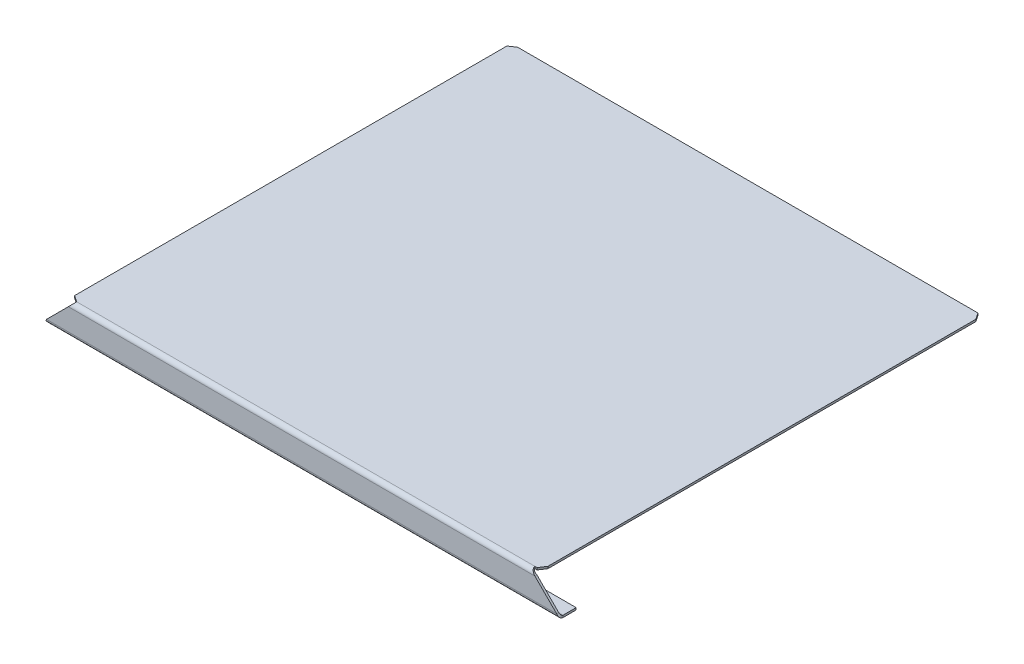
ISO-10303-21;
HEADER;
FILE_DESCRIPTION(('STEP AP214'),'2;1');
FILE_NAME('part.step','',(''),(''),'','','');
FILE_SCHEMA(('AUTOMOTIVE_DESIGN { 1 0 10303 214 1 1 1 1 }'));
ENDSEC;
DATA;
#1=APPLICATION_CONTEXT('core data for automotive mechanical design processes');
#2=APPLICATION_PROTOCOL_DEFINITION('international standard','automotive_design',2000,#1);
#3=PRODUCT_CONTEXT('',#1,'mechanical');
#4=PRODUCT('Part','Part','',(#3));
#5=PRODUCT_RELATED_PRODUCT_CATEGORY('part','',(#4));
#6=PRODUCT_DEFINITION_FORMATION('','',#4);
#7=PRODUCT_DEFINITION_CONTEXT('part definition',#1,'design');
#8=PRODUCT_DEFINITION('design','',#6,#7);
#9=PRODUCT_DEFINITION_SHAPE('','',#8);
#10=(LENGTH_UNIT() NAMED_UNIT(*) SI_UNIT(.MILLI.,.METRE.));
#11=(NAMED_UNIT(*) PLANE_ANGLE_UNIT() SI_UNIT($,.RADIAN.));
#12=(NAMED_UNIT(*) SI_UNIT($,.STERADIAN.) SOLID_ANGLE_UNIT());
#13=UNCERTAINTY_MEASURE_WITH_UNIT(LENGTH_MEASURE(1.E-05),#10,'distance_accuracy_value','');
#14=(GEOMETRIC_REPRESENTATION_CONTEXT(3) GLOBAL_UNCERTAINTY_ASSIGNED_CONTEXT((#13)) GLOBAL_UNIT_ASSIGNED_CONTEXT((#10,
#11,#12)) REPRESENTATION_CONTEXT('',''));
#15=CARTESIAN_POINT('',(0.,0.,0.));
#16=DIRECTION('',(0.,0.,1.));
#17=DIRECTION('',(1.,0.,0.));
#18=AXIS2_PLACEMENT_3D('',#15,#16,#17);
#19=CARTESIAN_POINT('',(0.,1.76452196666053E-12,654.05));
#20=DIRECTION('',(0.,0.,-1.));
#21=DIRECTION('',(0.,1.,0.));
#22=AXIS2_PLACEMENT_3D('',#19,#20,#21);
#23=PLANE('',#22);
#24=DIRECTION('',(0.707106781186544,0.707106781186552,0.));
#25=VECTOR('',#24,1.);
#26=CARTESIAN_POINT('',(22.2250000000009,-22.2249999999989,654.05));
#27=LINE('',#26,#25);
#28=CARTESIAN_POINT('',(6.22299999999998,-38.227,654.05));
#29=VERTEX_POINT('',#28);
#30=CARTESIAN_POINT('',(38.2269999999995,-6.22300000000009,654.05));
#31=VERTEX_POINT('',#30);
#32=EDGE_CURVE('E267',#29,#31,#27,.T.);
#33=ORIENTED_EDGE('',*,*,#32,.F.);
#34=DIRECTION('',(-1.,0.,0.));
#35=VECTOR('',#34,1.);
#36=CARTESIAN_POINT('',(0.,-38.227,654.05));
#37=LINE('',#36,#35);
#38=CARTESIAN_POINT('',(755.777,-38.227,654.05));
#39=VERTEX_POINT('',#38);
#40=EDGE_CURVE('E341',#29,#39,#37,.F.);
#41=ORIENTED_EDGE('',*,*,#40,.T.);
#42=DIRECTION('',(-0.707106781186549,0.707106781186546,0.));
#43=VECTOR('',#42,1.);
#44=CARTESIAN_POINT('',(358.774999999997,358.775000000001,654.049999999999));
#45=LINE('',#44,#43);
#46=CARTESIAN_POINT('',(723.773,-6.22300000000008,654.05));
#47=VERTEX_POINT('',#46);
#48=EDGE_CURVE('E290',#39,#47,#45,.T.);
#49=ORIENTED_EDGE('',*,*,#48,.T.);
#50=DIRECTION('',(-1.,0.,0.));
#51=VECTOR('',#50,1.);
#52=CARTESIAN_POINT('',(762.,-6.22300000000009,654.05));
#53=LINE('',#52,#51);
#54=EDGE_CURVE('E347',#31,#47,#53,.F.);
#55=ORIENTED_EDGE('',*,*,#54,.F.);
#56=EDGE_LOOP('',(#33,#41,#49,#55));
#57=FACE_BOUND('',#56,.T.);
#58=ADVANCED_FACE('F90',(#57),#23,.F.);
#59=CARTESIAN_POINT('',(0.,1.75387993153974E-12,651.002));
#60=DIRECTION('',(0.,0.,-1.));
#61=DIRECTION('',(0.,1.,0.));
#62=AXIS2_PLACEMENT_3D('',#59,#60,#61);
#63=PLANE('',#62);
#64=DIRECTION('',(-1.,0.,0.));
#65=VECTOR('',#64,1.);
#66=CARTESIAN_POINT('',(0.,-38.227,651.002));
#67=LINE('',#66,#65);
#68=CARTESIAN_POINT('',(6.22299999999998,-38.227,651.002));
#69=VERTEX_POINT('',#68);
#70=CARTESIAN_POINT('',(755.777,-38.227,651.002));
#71=VERTEX_POINT('',#70);
#72=EDGE_CURVE('E329',#69,#71,#67,.F.);
#73=ORIENTED_EDGE('',*,*,#72,.F.);
#74=DIRECTION('',(0.707106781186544,0.707106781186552,0.));
#75=VECTOR('',#74,1.);
#76=CARTESIAN_POINT('',(22.2250000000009,-22.2249999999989,651.002));
#77=LINE('',#76,#75);
#78=CARTESIAN_POINT('',(38.2269999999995,-6.2230000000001,651.002));
#79=VERTEX_POINT('',#78);
#80=EDGE_CURVE('E262',#69,#79,#77,.T.);
#81=ORIENTED_EDGE('',*,*,#80,.T.);
#82=DIRECTION('',(-1.,0.,0.));
#83=VECTOR('',#82,1.);
#84=CARTESIAN_POINT('',(762.,-6.22300000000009,651.002));
#85=LINE('',#84,#83);
#86=CARTESIAN_POINT('',(723.773,-6.22300000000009,651.002));
#87=VERTEX_POINT('',#86);
#88=EDGE_CURVE('E344',#87,#79,#85,.T.);
#89=ORIENTED_EDGE('',*,*,#88,.F.);
#90=DIRECTION('',(-0.707106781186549,0.707106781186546,0.));
#91=VECTOR('',#90,1.);
#92=CARTESIAN_POINT('',(358.774999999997,358.775000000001,651.001999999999));
#93=LINE('',#92,#91);
#94=EDGE_CURVE('E295',#71,#87,#93,.T.);
#95=ORIENTED_EDGE('',*,*,#94,.F.);
#96=EDGE_LOOP('',(#73,#81,#89,#95));
#97=FACE_BOUND('',#96,.T.);
#98=ADVANCED_FACE('F495',(#97),#63,.T.);
#99=CARTESIAN_POINT('',(0.,-3.048,0.));
#100=DIRECTION('',(0.,1.,0.));
#101=DIRECTION('',(0.,0.,1.));
#102=AXIS2_PLACEMENT_3D('',#99,#100,#101);
#103=PLANE('',#102);
#104=DIRECTION('',(-1.,0.,0.));
#105=VECTOR('',#104,1.);
#106=CARTESIAN_POINT('',(1.11022302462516E-13,-3.04800000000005,647.827));
#107=LINE('',#106,#105);
#108=CARTESIAN_POINT('',(44.4499999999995,-3.048,647.827));
#109=VERTEX_POINT('',#108);
#110=CARTESIAN_POINT('',(717.55,-3.04800000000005,647.827));
#111=VERTEX_POINT('',#110);
#112=EDGE_CURVE('E245',#109,#111,#107,.F.);
#113=ORIENTED_EDGE('',*,*,#112,.F.);
#114=DIRECTION('',(0.832050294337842,0.,0.554700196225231));
#115=VECTOR('',#114,1.);
#116=CARTESIAN_POINT('',(44.4500000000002,-3.048,647.827));
#117=LINE('',#116,#115);
#118=CARTESIAN_POINT('',(34.9250000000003,-3.04800000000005,641.477));
#119=VERTEX_POINT('',#118);
#120=EDGE_CURVE('E248',#109,#119,#117,.F.);
#121=ORIENTED_EDGE('',*,*,#120,.T.);
#122=DIRECTION('',(0.,0.,-1.));
#123=VECTOR('',#122,1.);
#124=CARTESIAN_POINT('',(34.9250000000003,-3.04800000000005,647.827));
#125=LINE('',#124,#123);
#126=CARTESIAN_POINT('',(34.9250000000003,-3.048,6.34999999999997));
#127=VERTEX_POINT('',#126);
#128=EDGE_CURVE('E405',#119,#127,#125,.T.);
#129=ORIENTED_EDGE('',*,*,#128,.T.);
#130=DIRECTION('',(-0.832050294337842,0.,0.554700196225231));
#131=VECTOR('',#130,1.);
#132=CARTESIAN_POINT('',(44.4500000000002,-3.048,0.));
#133=LINE('',#132,#131);
#134=CARTESIAN_POINT('',(44.4500000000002,-3.048,0.));
#135=VERTEX_POINT('',#134);
#136=EDGE_CURVE('E389',#127,#135,#133,.F.);
#137=ORIENTED_EDGE('',*,*,#136,.T.);
#138=DIRECTION('',(-1.,0.,0.));
#139=VECTOR('',#138,1.);
#140=CARTESIAN_POINT('',(0.,-3.048,0.));
#141=LINE('',#140,#139);
#142=CARTESIAN_POINT('',(720.725,-3.048,0.));
#143=VERTEX_POINT('',#142);
#144=EDGE_CURVE('E356',#143,#135,#141,.T.);
#145=ORIENTED_EDGE('',*,*,#144,.F.);
#146=DIRECTION('',(-0.554700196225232,0.,-0.832050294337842));
#147=VECTOR('',#146,1.);
#148=CARTESIAN_POINT('',(727.075,-3.048,9.52499999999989));
#149=LINE('',#148,#147);
#150=CARTESIAN_POINT('',(727.075,-3.048,9.5249999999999));
#151=VERTEX_POINT('',#150);
#152=EDGE_CURVE('E371',#143,#151,#149,.F.);
#153=ORIENTED_EDGE('',*,*,#152,.T.);
#154=DIRECTION('',(0.,0.,-1.));
#155=VECTOR('',#154,1.);
#156=CARTESIAN_POINT('',(727.075,-3.04800000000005,647.827));
#157=LINE('',#156,#155);
#158=CARTESIAN_POINT('',(727.075,-3.04800000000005,638.302));
#159=VERTEX_POINT('',#158);
#160=EDGE_CURVE('E421',#159,#151,#157,.T.);
#161=ORIENTED_EDGE('',*,*,#160,.F.);
#162=DIRECTION('',(-0.554700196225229,0.,0.832050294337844));
#163=VECTOR('',#162,1.);
#164=CARTESIAN_POINT('',(727.075,-3.048,638.302));
#165=LINE('',#164,#163);
#166=CARTESIAN_POINT('',(720.725,-3.04800000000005,647.827));
#167=VERTEX_POINT('',#166);
#168=EDGE_CURVE('E374',#159,#167,#165,.T.);
#169=ORIENTED_EDGE('',*,*,#168,.T.);
#170=DIRECTION('',(-1.,0.,0.));
#171=VECTOR('',#170,1.);
#172=CARTESIAN_POINT('',(727.075,-3.04800000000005,647.827));
#173=LINE('',#172,#171);
#174=EDGE_CURVE('E439',#167,#111,#173,.T.);
#175=ORIENTED_EDGE('',*,*,#174,.T.);
#176=EDGE_LOOP('',(#113,#121,#129,#137,#145,#153,#161,#169,#175));
#177=FACE_BOUND('',#176,.T.);
#178=ADVANCED_FACE('F411',(#177),#103,.F.);
#179=CARTESIAN_POINT('',(0.,0.,0.));
#180=DIRECTION('',(0.,1.,0.));
#181=DIRECTION('',(0.,0.,1.));
#182=AXIS2_PLACEMENT_3D('',#179,#180,#181);
#183=PLANE('',#182);
#184=DIRECTION('',(0.,0.,1.));
#185=VECTOR('',#184,1.);
#186=CARTESIAN_POINT('',(34.9250000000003,0.,647.827));
#187=LINE('',#186,#185);
#188=CARTESIAN_POINT('',(34.9250000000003,0.,6.34999999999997));
#189=VERTEX_POINT('',#188);
#190=CARTESIAN_POINT('',(34.9250000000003,0.,641.477));
#191=VERTEX_POINT('',#190);
#192=EDGE_CURVE('E219',#189,#191,#187,.T.);
#193=ORIENTED_EDGE('',*,*,#192,.T.);
#194=DIRECTION('',(-0.832050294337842,0.,-0.554700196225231));
#195=VECTOR('',#194,1.);
#196=CARTESIAN_POINT('',(-285.320153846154,0.,427.980230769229));
#197=LINE('',#196,#195);
#198=CARTESIAN_POINT('',(44.4500000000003,0.,647.827));
#199=VERTEX_POINT('',#198);
#200=EDGE_CURVE('E100',#191,#199,#197,.F.);
#201=ORIENTED_EDGE('',*,*,#200,.T.);
#202=DIRECTION('',(-1.,0.,0.));
#203=VECTOR('',#202,1.);
#204=CARTESIAN_POINT('',(1.11022302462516E-13,0.,647.827));
#205=LINE('',#204,#203);
#206=CARTESIAN_POINT('',(717.55,0.,647.827));
#207=VERTEX_POINT('',#206);
#208=EDGE_CURVE('E217',#199,#207,#205,.F.);
#209=ORIENTED_EDGE('',*,*,#208,.T.);
#210=DIRECTION('',(-1.,0.,0.));
#211=VECTOR('',#210,1.);
#212=CARTESIAN_POINT('',(727.075,0.,647.827));
#213=LINE('',#212,#211);
#214=CARTESIAN_POINT('',(720.725,0.,647.827));
#215=VERTEX_POINT('',#214);
#216=EDGE_CURVE('E433',#215,#207,#213,.T.);
#217=ORIENTED_EDGE('',*,*,#216,.F.);
#218=DIRECTION('',(0.554700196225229,0.,-0.832050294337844));
#219=VECTOR('',#218,1.);
#220=CARTESIAN_POINT('',(797.960538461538,0.,531.973692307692));
#221=LINE('',#220,#219);
#222=CARTESIAN_POINT('',(727.075,0.,638.302));
#223=VERTEX_POINT('',#222);
#224=EDGE_CURVE('E383',#215,#223,#221,.T.);
#225=ORIENTED_EDGE('',*,*,#224,.T.);
#226=DIRECTION('',(0.,0.,1.));
#227=VECTOR('',#226,1.);
#228=CARTESIAN_POINT('',(727.075,0.,647.827));
#229=LINE('',#228,#227);
#230=CARTESIAN_POINT('',(727.075,0.,9.5249999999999));
#231=VERTEX_POINT('',#230);
#232=EDGE_CURVE('E428',#231,#223,#229,.T.);
#233=ORIENTED_EDGE('',*,*,#232,.F.);
#234=DIRECTION('',(0.554700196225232,0.,0.832050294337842));
#235=VECTOR('',#234,1.);
#236=CARTESIAN_POINT('',(498.963461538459,0.,-332.642307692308));
#237=LINE('',#236,#235);
#238=CARTESIAN_POINT('',(720.725,0.,0.));
#239=VERTEX_POINT('',#238);
#240=EDGE_CURVE('E380',#231,#239,#237,.F.);
#241=ORIENTED_EDGE('',*,*,#240,.T.);
#242=DIRECTION('',(-1.,0.,0.));
#243=VECTOR('',#242,1.);
#244=CARTESIAN_POINT('',(0.,0.,0.));
#245=LINE('',#244,#243);
#246=CARTESIAN_POINT('',(44.4500000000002,0.,0.));
#247=VERTEX_POINT('',#246);
#248=EDGE_CURVE('E244',#239,#247,#245,.T.);
#249=ORIENTED_EDGE('',*,*,#248,.T.);
#250=DIRECTION('',(0.832050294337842,0.,-0.554700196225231));
#251=VECTOR('',#250,1.);
#252=CARTESIAN_POINT('',(13.6769230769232,0.,20.5153846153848));
#253=LINE('',#252,#251);
#254=EDGE_CURVE('E107',#247,#189,#253,.F.);
#255=ORIENTED_EDGE('',*,*,#254,.T.);
#256=EDGE_LOOP('',(#193,#201,#209,#217,#225,#233,#241,#249,#255));
#257=FACE_BOUND('',#256,.T.);
#258=ADVANCED_FACE('F214',(#257),#183,.T.);
#259=CARTESIAN_POINT('',(0.,-3.048,0.));
#260=DIRECTION('',(0.,0.,-1.));
#261=DIRECTION('',(-1.,0.,0.));
#262=AXIS2_PLACEMENT_3D('',#259,#260,#261);
#263=PLANE('',#262);
#264=ORIENTED_EDGE('',*,*,#144,.T.);
#265=DIRECTION('',(0.,1.,0.));
#266=VECTOR('',#265,1.);
#267=CARTESIAN_POINT('',(44.4500000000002,-3.048,0.));
#268=LINE('',#267,#266);
#269=EDGE_CURVE('E13',#135,#247,#268,.T.);
#270=ORIENTED_EDGE('',*,*,#269,.T.);
#271=ORIENTED_EDGE('',*,*,#248,.F.);
#272=DIRECTION('',(0.,-1.,0.));
#273=VECTOR('',#272,1.);
#274=CARTESIAN_POINT('',(720.725,-3.048,0.));
#275=LINE('',#274,#273);
#276=EDGE_CURVE('E386',#239,#143,#275,.T.);
#277=ORIENTED_EDGE('',*,*,#276,.T.);
#278=EDGE_LOOP('',(#264,#270,#271,#277));
#279=FACE_BOUND('',#278,.T.);
#280=ADVANCED_FACE('F414',(#279),#263,.T.);
#281=CARTESIAN_POINT('',(1.11022302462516E-13,-6.22300000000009,647.827));
#282=DIRECTION('',(-1.,0.,0.));
#283=DIRECTION('',(0.,0.,1.));
#284=AXIS2_PLACEMENT_3D('',#281,#282,#283);
#285=CYLINDRICAL_SURFACE('',#284,6.22300000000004);
#286=ORIENTED_EDGE('',*,*,#208,.F.);
#287=CARTESIAN_POINT('',(38.2269999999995,-6.22300000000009,647.827));
#288=DIRECTION('',(-0.707106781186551,0.707106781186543,0.));
#289=DIRECTION('',(-0.707106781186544,-0.707106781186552,0.));
#290=AXIS2_PLACEMENT_3D('',#287,#288,#289);
#291=ELLIPSE('',#290,8.80065099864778,6.22300000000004);
#292=EDGE_CURVE('E226',#199,#31,#291,.F.);
#293=ORIENTED_EDGE('',*,*,#292,.T.);
#294=ORIENTED_EDGE('',*,*,#54,.T.);
#295=CARTESIAN_POINT('',(723.773,-6.22300000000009,647.827));
#296=DIRECTION('',(-0.707106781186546,-0.707106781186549,0.));
#297=DIRECTION('',(-0.707106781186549,0.707106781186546,0.));
#298=AXIS2_PLACEMENT_3D('',#295,#296,#297);
#299=ELLIPSE('',#298,8.80065099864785,6.22300000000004);
#300=EDGE_CURVE('E242',#207,#47,#299,.F.);
#301=ORIENTED_EDGE('',*,*,#300,.F.);
#302=EDGE_LOOP('',(#286,#293,#294,#301));
#303=FACE_BOUND('',#302,.T.);
#304=ADVANCED_FACE('F240',(#303),#285,.T.);
#305=CARTESIAN_POINT('',(1.11022302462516E-13,-6.22300000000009,647.827));
#306=DIRECTION('',(-1.,0.,0.));
#307=DIRECTION('',(0.,0.,1.));
#308=AXIS2_PLACEMENT_3D('',#305,#306,#307);
#309=CYLINDRICAL_SURFACE('',#308,3.17500000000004);
#310=CARTESIAN_POINT('',(38.2269999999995,-6.22300000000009,647.827));
#311=DIRECTION('',(-0.45447034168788,0.89076186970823,0.));
#312=DIRECTION('',(-0.89076186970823,-0.45447034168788,0.));
#313=AXIS2_PLACEMENT_3D('',#310,#311,#312);
#314=ELLIPSE('',#313,6.98615445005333,3.17500000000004);
#315=EDGE_CURVE('E236',#109,#79,#314,.F.);
#316=ORIENTED_EDGE('',*,*,#315,.F.);
#317=ORIENTED_EDGE('',*,*,#112,.T.);
#318=CARTESIAN_POINT('',(723.773,-6.22300000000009,647.827));
#319=DIRECTION('',(-0.454470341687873,-0.890761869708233,0.));
#320=DIRECTION('',(-0.890761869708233,0.454470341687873,0.));
#321=AXIS2_PLACEMENT_3D('',#318,#319,#320);
#322=ELLIPSE('',#321,6.98615445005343,3.17500000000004);
#323=EDGE_CURVE('E277',#111,#87,#322,.F.);
#324=ORIENTED_EDGE('',*,*,#323,.T.);
#325=ORIENTED_EDGE('',*,*,#88,.T.);
#326=EDGE_LOOP('',(#316,#317,#324,#325));
#327=FACE_BOUND('',#326,.T.);
#328=ADVANCED_FACE('F497',(#327),#309,.F.);
#329=CARTESIAN_POINT('',(0.,-38.227,647.827));
#330=DIRECTION('',(-1.,0.,0.));
#331=DIRECTION('',(0.,-1.,0.));
#332=AXIS2_PLACEMENT_3D('',#329,#330,#331);
#333=CYLINDRICAL_SURFACE('',#332,6.22299999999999);
#334=ORIENTED_EDGE('',*,*,#40,.F.);
#335=CARTESIAN_POINT('',(6.22299999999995,-38.227,647.827));
#336=DIRECTION('',(-0.890761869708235,0.454470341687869,0.));
#337=DIRECTION('',(-0.454470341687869,-0.890761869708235,0.));
#338=AXIS2_PLACEMENT_3D('',#335,#336,#337);
#339=ELLIPSE('',#338,6.98615445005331,6.22299999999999);
#340=CARTESIAN_POINT('',(3.04799999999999,-44.45,647.827));
#341=VERTEX_POINT('',#340);
#342=EDGE_CURVE('E237',#29,#341,#339,.F.);
#343=ORIENTED_EDGE('',*,*,#342,.T.);
#344=DIRECTION('',(-1.,0.,0.));
#345=VECTOR('',#344,1.);
#346=CARTESIAN_POINT('',(0.,-44.45,647.827));
#347=LINE('',#346,#345);
#348=CARTESIAN_POINT('',(758.952,-44.45,647.827));
#349=VERTEX_POINT('',#348);
#350=EDGE_CURVE('E334',#349,#341,#347,.T.);
#351=ORIENTED_EDGE('',*,*,#350,.F.);
#352=CARTESIAN_POINT('',(755.777,-38.227,647.827));
#353=DIRECTION('',(-0.890761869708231,-0.454470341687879,0.));
#354=DIRECTION('',(-0.454470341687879,0.890761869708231,0.));
#355=AXIS2_PLACEMENT_3D('',#352,#353,#354);
#356=ELLIPSE('',#355,6.98615445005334,6.22299999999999);
#357=EDGE_CURVE('E284',#39,#349,#356,.F.);
#358=ORIENTED_EDGE('',*,*,#357,.F.);
#359=EDGE_LOOP('',(#334,#343,#351,#358));
#360=FACE_BOUND('',#359,.T.);
#361=ADVANCED_FACE('F467',(#360),#333,.T.);
#362=CARTESIAN_POINT('',(0.,-38.227,647.827));
#363=DIRECTION('',(-1.,0.,0.));
#364=DIRECTION('',(0.,-1.,0.));
#365=AXIS2_PLACEMENT_3D('',#362,#363,#364);
#366=CYLINDRICAL_SURFACE('',#365,3.17499999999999);
#367=CARTESIAN_POINT('',(6.22299999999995,-38.227,647.827));
#368=DIRECTION('',(-0.707106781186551,0.707106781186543,0.));
#369=DIRECTION('',(-0.707106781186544,-0.707106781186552,0.));
#370=AXIS2_PLACEMENT_3D('',#367,#368,#369);
#371=ELLIPSE('',#370,4.49012806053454,3.17499999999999);
#372=CARTESIAN_POINT('',(3.04799999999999,-41.402,647.827));
#373=VERTEX_POINT('',#372);
#374=EDGE_CURVE('E441',#69,#373,#371,.F.);
#375=ORIENTED_EDGE('',*,*,#374,.F.);
#376=ORIENTED_EDGE('',*,*,#72,.T.);
#377=CARTESIAN_POINT('',(755.777,-38.227,647.827));
#378=DIRECTION('',(-0.707106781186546,-0.707106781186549,0.));
#379=DIRECTION('',(-0.707106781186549,0.707106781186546,0.));
#380=AXIS2_PLACEMENT_3D('',#377,#378,#379);
#381=ELLIPSE('',#380,4.49012806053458,3.17499999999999);
#382=CARTESIAN_POINT('',(758.952,-41.402,647.827));
#383=VERTEX_POINT('',#382);
#384=EDGE_CURVE('E273',#71,#383,#381,.F.);
#385=ORIENTED_EDGE('',*,*,#384,.T.);
#386=DIRECTION('',(1.,0.,0.));
#387=VECTOR('',#386,1.);
#388=CARTESIAN_POINT('',(762.,-41.402,647.827));
#389=LINE('',#388,#387);
#390=EDGE_CURVE('E324',#383,#373,#389,.F.);
#391=ORIENTED_EDGE('',*,*,#390,.T.);
#392=EDGE_LOOP('',(#375,#376,#385,#391));
#393=FACE_BOUND('',#392,.T.);
#394=ADVANCED_FACE('F484',(#393),#366,.F.);
#395=CARTESIAN_POINT('',(0.,-44.450000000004,2.86620769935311E-13));
#396=DIRECTION('',(0.,-1.,0.));
#397=DIRECTION('',(0.,0.,-1.));
#398=AXIS2_PLACEMENT_3D('',#395,#396,#397);
#399=PLANE('',#398);
#400=ORIENTED_EDGE('',*,*,#350,.T.);
#401=DIRECTION('',(0.,0.,-1.));
#402=VECTOR('',#401,1.);
#403=CARTESIAN_POINT('',(3.04799999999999,-44.450000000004,2.86729569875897E-13));
#404=LINE('',#403,#402);
#405=CARTESIAN_POINT('',(3.04799999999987,-44.4500000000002,628.65));
#406=VERTEX_POINT('',#405);
#407=EDGE_CURVE('E255',#341,#406,#404,.T.);
#408=ORIENTED_EDGE('',*,*,#407,.T.);
#409=DIRECTION('',(-1.,0.,0.));
#410=VECTOR('',#409,1.);
#411=CARTESIAN_POINT('',(0.,-44.4500000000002,628.65));
#412=LINE('',#411,#410);
#413=CARTESIAN_POINT('',(758.952,-44.4500000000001,628.65));
#414=VERTEX_POINT('',#413);
#415=EDGE_CURVE('E325',#414,#406,#412,.T.);
#416=ORIENTED_EDGE('',*,*,#415,.F.);
#417=DIRECTION('',(0.,0.,-1.));
#418=VECTOR('',#417,1.);
#419=CARTESIAN_POINT('',(758.952,-44.450000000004,2.86729569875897E-13));
#420=LINE('',#419,#418);
#421=EDGE_CURVE('E308',#349,#414,#420,.T.);
#422=ORIENTED_EDGE('',*,*,#421,.F.);
#423=EDGE_LOOP('',(#400,#408,#416,#422));
#424=FACE_BOUND('',#423,.T.);
#425=ADVANCED_FACE('F471',(#424),#399,.T.);
#426=CARTESIAN_POINT('',(0.,-41.402000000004,2.67805313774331E-13));
#427=DIRECTION('',(0.,-1.,0.));
#428=DIRECTION('',(0.,0.,-1.));
#429=AXIS2_PLACEMENT_3D('',#426,#427,#428);
#430=PLANE('',#429);
#431=DIRECTION('',(0.,0.,-1.));
#432=VECTOR('',#431,1.);
#433=CARTESIAN_POINT('',(3.04799999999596,-41.402000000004,2.48881057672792E-13));
#434=LINE('',#433,#432);
#435=CARTESIAN_POINT('',(3.04799999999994,-41.4020000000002,628.65));
#436=VERTEX_POINT('',#435);
#437=EDGE_CURVE('E250',#373,#436,#434,.T.);
#438=ORIENTED_EDGE('',*,*,#437,.F.);
#439=ORIENTED_EDGE('',*,*,#390,.F.);
#440=DIRECTION('',(0.,0.,-1.));
#441=VECTOR('',#440,1.);
#442=CARTESIAN_POINT('',(758.952000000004,-41.402000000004,4.9799450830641E-12));
#443=LINE('',#442,#441);
#444=CARTESIAN_POINT('',(758.952,-41.4020000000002,628.65));
#445=VERTEX_POINT('',#444);
#446=EDGE_CURVE('E281',#383,#445,#443,.T.);
#447=ORIENTED_EDGE('',*,*,#446,.T.);
#448=DIRECTION('',(1.,0.,0.));
#449=VECTOR('',#448,1.);
#450=CARTESIAN_POINT('',(0.,-41.4020000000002,628.65));
#451=LINE('',#450,#449);
#452=EDGE_CURVE('E330',#445,#436,#451,.F.);
#453=ORIENTED_EDGE('',*,*,#452,.T.);
#454=EDGE_LOOP('',(#438,#439,#447,#453));
#455=FACE_BOUND('',#454,.T.);
#456=ADVANCED_FACE('F480',(#455),#430,.F.);
#457=CARTESIAN_POINT('',(0.,-44.4500000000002,628.65));
#458=DIRECTION('',(0.,0.,-1.));
#459=DIRECTION('',(0.,1.,0.));
#460=AXIS2_PLACEMENT_3D('',#457,#458,#459);
#461=PLANE('',#460);
#462=ORIENTED_EDGE('',*,*,#415,.T.);
#463=DIRECTION('',(0.,1.,0.));
#464=VECTOR('',#463,1.);
#465=CARTESIAN_POINT('',(3.04799999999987,-41.4020000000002,628.65));
#466=LINE('',#465,#464);
#467=EDGE_CURVE('E270',#436,#406,#466,.F.);
#468=ORIENTED_EDGE('',*,*,#467,.F.);
#469=ORIENTED_EDGE('',*,*,#452,.F.);
#470=DIRECTION('',(0.,1.,0.));
#471=VECTOR('',#470,1.);
#472=CARTESIAN_POINT('',(758.952,-41.4020000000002,628.65));
#473=LINE('',#472,#471);
#474=EDGE_CURVE('E299',#445,#414,#473,.F.);
#475=ORIENTED_EDGE('',*,*,#474,.T.);
#476=EDGE_LOOP('',(#462,#468,#469,#475));
#477=FACE_BOUND('',#476,.T.);
#478=ADVANCED_FACE('F478',(#477),#461,.T.);
#479=CARTESIAN_POINT('',(758.952000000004,-41.402000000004,4.9799450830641E-12));
#480=DIRECTION('',(-1.,0.,0.));
#481=DIRECTION('',(0.,0.,-1.));
#482=AXIS2_PLACEMENT_3D('',#479,#480,#481);
#483=PLANE('',#482);
#484=ORIENTED_EDGE('',*,*,#474,.F.);
#485=ORIENTED_EDGE('',*,*,#446,.F.);
#486=DIRECTION('',(0.,1.,0.));
#487=VECTOR('',#486,1.);
#488=CARTESIAN_POINT('',(758.952,-41.402,647.827));
#489=LINE('',#488,#487);
#490=EDGE_CURVE('E311',#383,#349,#489,.F.);
#491=ORIENTED_EDGE('',*,*,#490,.T.);
#492=ORIENTED_EDGE('',*,*,#421,.T.);
#493=EDGE_LOOP('',(#484,#485,#491,#492));
#494=FACE_BOUND('',#493,.T.);
#495=ADVANCED_FACE('F474',(#494),#483,.F.);
#496=CARTESIAN_POINT('',(752.602,-32.004,647.827));
#497=CARTESIAN_POINT('',(752.602,-33.02,647.827));
#498=CARTESIAN_POINT('',(752.602,-34.036,647.827));
#499=CARTESIAN_POINT('',(752.602,-35.052,647.827));
#500=CARTESIAN_POINT('',(752.602,-32.004,660.273));
#501=CARTESIAN_POINT('',(752.602,-33.0200000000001,658.241));
#502=CARTESIAN_POINT('',(752.602,-34.036,656.209));
#503=CARTESIAN_POINT('',(752.602,-35.052,654.177));
#504=CARTESIAN_POINT('',(758.952,-44.45,660.273));
#505=CARTESIAN_POINT('',(758.952,-43.434,658.241));
#506=CARTESIAN_POINT('',(758.952,-42.418,656.209));
#507=CARTESIAN_POINT('',(758.952,-41.402,654.177));
#508=CARTESIAN_POINT('',(758.952,-44.45,647.827));
#509=CARTESIAN_POINT('',(758.952,-43.434,647.827));
#510=CARTESIAN_POINT('',(758.952,-42.418,647.827));
#511=CARTESIAN_POINT('',(758.952,-41.402,647.827));
#512=CARTESIAN_POINT('',(758.952,-44.45,635.381));
#513=CARTESIAN_POINT('',(758.952,-43.434,637.413));
#514=CARTESIAN_POINT('',(758.952,-42.418,639.445));
#515=CARTESIAN_POINT('',(758.952,-41.402,641.477));
#516=CARTESIAN_POINT('',(752.602,-32.004,635.381));
#517=CARTESIAN_POINT('',(752.602,-33.0200000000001,637.413));
#518=CARTESIAN_POINT('',(752.602,-34.036,639.445));
#519=CARTESIAN_POINT('',(752.602,-35.052,641.477));
#520=CARTESIAN_POINT('',(752.602,-32.004,647.827));
#521=CARTESIAN_POINT('',(752.602,-33.02,647.827));
#522=CARTESIAN_POINT('',(752.602,-34.036,647.827));
#523=CARTESIAN_POINT('',(752.602,-35.052,647.827));
#524=(BOUNDED_SURFACE() B_SPLINE_SURFACE(3,3,((#496,#497,#498,#499),(#500,#501,#502,#503),(#504,
#505,#506,#507),(#508,#509,#510,#511),(#512,#513,#514,#515),(#516,#517,#518,#519),(#520,#521,
#522,#523)),.UNSPECIFIED.,.T.,.F.,.F.) B_SPLINE_SURFACE_WITH_KNOTS((4,3,4),(4,4),(0.,0.5,1.),
(0.,1.),.UNSPECIFIED.) GEOMETRIC_REPRESENTATION_ITEM() RATIONAL_B_SPLINE_SURFACE(((1.,1.,1.,1.),
(0.333333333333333,0.333333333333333,0.333333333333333,0.333333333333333),(0.333333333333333,
0.333333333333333,0.333333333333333,0.333333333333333),(1.,1.,1.,1.),(0.333333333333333,
0.333333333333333,0.333333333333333,0.333333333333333),(0.333333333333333,0.333333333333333,
0.333333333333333,0.333333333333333),(1.,1.,1.,1.))) REPRESENTATION_ITEM('') SURFACE());
#525=DIRECTION('',(0.,0.,-1.));
#526=VECTOR('',#525,1.);
#527=CARTESIAN_POINT('',(755.777,-38.227,651.002));
#528=LINE('',#527,#526);
#529=EDGE_CURVE('E294',#71,#39,#528,.F.);
#530=ORIENTED_EDGE('',*,*,#490,.F.);
#531=ORIENTED_EDGE('',*,*,#384,.F.);
#532=ORIENTED_EDGE('',*,*,#529,.T.);
#533=ORIENTED_EDGE('',*,*,#357,.T.);
#534=EDGE_LOOP('',(#530,#531,#532,#533));
#535=FACE_BOUND('',#534,.T.);
#536=ADVANCED_FACE('F488',(#535),#524,.T.);
#537=CARTESIAN_POINT('',(358.774999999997,358.775000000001,651.001999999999));
#538=DIRECTION('',(-0.707106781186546,-0.707106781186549,0.));
#539=DIRECTION('',(-0.707106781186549,0.707106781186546,0.));
#540=AXIS2_PLACEMENT_3D('',#537,#538,#539);
#541=PLANE('',#540);
#542=ORIENTED_EDGE('',*,*,#94,.T.);
#543=DIRECTION('',(0.,0.,-1.));
#544=VECTOR('',#543,1.);
#545=CARTESIAN_POINT('',(723.773,-6.22300000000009,651.002));
#546=LINE('',#545,#544);
#547=EDGE_CURVE('E300',#87,#47,#546,.F.);
#548=ORIENTED_EDGE('',*,*,#547,.T.);
#549=ORIENTED_EDGE('',*,*,#48,.F.);
#550=ORIENTED_EDGE('',*,*,#529,.F.);
#551=EDGE_LOOP('',(#542,#548,#549,#550));
#552=FACE_BOUND('',#551,.T.);
#553=ADVANCED_FACE('F492',(#552),#541,.F.);
#554=CARTESIAN_POINT('',(717.55,0.,647.827));
#555=CARTESIAN_POINT('',(717.55,-1.01600000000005,647.827));
#556=CARTESIAN_POINT('',(717.55,-2.03200000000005,647.827));
#557=CARTESIAN_POINT('',(717.55,-3.04800000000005,647.827));
#558=CARTESIAN_POINT('',(717.55,0.,660.273));
#559=CARTESIAN_POINT('',(717.55,-1.01600000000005,658.241));
#560=CARTESIAN_POINT('',(717.55,-2.03200000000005,656.209));
#561=CARTESIAN_POINT('',(717.55,-3.04800000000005,654.177));
#562=CARTESIAN_POINT('',(729.996,-12.4460000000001,660.273));
#563=CARTESIAN_POINT('',(729.996,-11.4300000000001,658.241));
#564=CARTESIAN_POINT('',(729.996,-10.4140000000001,656.209));
#565=CARTESIAN_POINT('',(729.996,-9.39800000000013,654.177));
#566=CARTESIAN_POINT('',(729.996,-12.4460000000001,647.827));
#567=CARTESIAN_POINT('',(729.996,-11.4300000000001,647.827));
#568=CARTESIAN_POINT('',(729.996,-10.4140000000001,647.827));
#569=CARTESIAN_POINT('',(729.996,-9.39800000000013,647.827));
#570=CARTESIAN_POINT('',(729.996,-12.4460000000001,635.381));
#571=CARTESIAN_POINT('',(729.996,-11.4300000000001,637.413));
#572=CARTESIAN_POINT('',(729.996,-10.4140000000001,639.445));
#573=CARTESIAN_POINT('',(729.996,-9.39800000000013,641.477));
#574=CARTESIAN_POINT('',(717.55,0.,635.381));
#575=CARTESIAN_POINT('',(717.55,-1.01600000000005,637.413));
#576=CARTESIAN_POINT('',(717.55,-2.03200000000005,639.445));
#577=CARTESIAN_POINT('',(717.55,-3.04800000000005,641.477));
#578=CARTESIAN_POINT('',(717.55,0.,647.827));
#579=CARTESIAN_POINT('',(717.55,-1.01600000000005,647.827));
#580=CARTESIAN_POINT('',(717.55,-2.03200000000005,647.827));
#581=CARTESIAN_POINT('',(717.55,-3.04800000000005,647.827));
#582=(BOUNDED_SURFACE() B_SPLINE_SURFACE(3,3,((#554,#555,#556,#557),(#558,#559,#560,#561),(#562,
#563,#564,#565),(#566,#567,#568,#569),(#570,#571,#572,#573),(#574,#575,#576,#577),(#578,#579,
#580,#581)),.UNSPECIFIED.,.T.,.F.,.F.) B_SPLINE_SURFACE_WITH_KNOTS((4,3,4),(4,4),(0.,0.5,1.),
(0.,1.),.UNSPECIFIED.) GEOMETRIC_REPRESENTATION_ITEM() RATIONAL_B_SPLINE_SURFACE(((1.,1.,1.,1.),
(0.333333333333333,0.333333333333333,0.333333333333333,0.333333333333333),(0.333333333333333,
0.333333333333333,0.333333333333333,0.333333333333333),(1.,1.,1.,1.),(0.333333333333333,
0.333333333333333,0.333333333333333,0.333333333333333),(0.333333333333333,0.333333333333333,
0.333333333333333,0.333333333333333),(1.,1.,1.,1.))) REPRESENTATION_ITEM('') SURFACE());
#583=DIRECTION('',(0.,1.,0.));
#584=VECTOR('',#583,1.);
#585=CARTESIAN_POINT('',(717.55,0.,647.827));
#586=LINE('',#585,#584);
#587=EDGE_CURVE('E304',#207,#111,#586,.F.);
#588=ORIENTED_EDGE('',*,*,#300,.T.);
#589=ORIENTED_EDGE('',*,*,#547,.F.);
#590=ORIENTED_EDGE('',*,*,#323,.F.);
#591=ORIENTED_EDGE('',*,*,#587,.F.);
#592=EDGE_LOOP('',(#588,#589,#590,#591));
#593=FACE_BOUND('',#592,.T.);
#594=ADVANCED_FACE('F500',(#593),#582,.T.);
#595=CARTESIAN_POINT('',(22.2250000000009,-22.2249999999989,654.05));
#596=DIRECTION('',(-0.707106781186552,0.707106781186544,0.));
#597=DIRECTION('',(0.707106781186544,0.707106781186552,0.));
#598=AXIS2_PLACEMENT_3D('',#595,#596,#597);
#599=PLANE('',#598);
#600=ORIENTED_EDGE('',*,*,#32,.T.);
#601=DIRECTION('',(0.,0.,1.));
#602=VECTOR('',#601,1.);
#603=CARTESIAN_POINT('',(38.2269999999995,-6.22300000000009,654.05));
#604=LINE('',#603,#602);
#605=EDGE_CURVE('E231',#31,#79,#604,.F.);
#606=ORIENTED_EDGE('',*,*,#605,.T.);
#607=ORIENTED_EDGE('',*,*,#80,.F.);
#608=DIRECTION('',(0.,0.,1.));
#609=VECTOR('',#608,1.);
#610=CARTESIAN_POINT('',(6.22299999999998,-38.227,654.05));
#611=LINE('',#610,#609);
#612=EDGE_CURVE('E266',#29,#69,#611,.F.);
#613=ORIENTED_EDGE('',*,*,#612,.F.);
#614=EDGE_LOOP('',(#600,#606,#607,#613));
#615=FACE_BOUND('',#614,.T.);
#616=ADVANCED_FACE('F503',(#615),#599,.T.);
#617=CARTESIAN_POINT('',(3.04799999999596,-41.402000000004,2.48881057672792E-13));
#618=DIRECTION('',(-1.,0.,0.));
#619=DIRECTION('',(0.,0.,-1.));
#620=AXIS2_PLACEMENT_3D('',#617,#618,#619);
#621=PLANE('',#620);
#622=ORIENTED_EDGE('',*,*,#437,.T.);
#623=ORIENTED_EDGE('',*,*,#467,.T.);
#624=ORIENTED_EDGE('',*,*,#407,.F.);
#625=DIRECTION('',(0.,1.,0.));
#626=VECTOR('',#625,1.);
#627=CARTESIAN_POINT('',(3.04799999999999,-41.402,647.827));
#628=LINE('',#627,#626);
#629=EDGE_CURVE('E260',#373,#341,#628,.F.);
#630=ORIENTED_EDGE('',*,*,#629,.F.);
#631=EDGE_LOOP('',(#622,#623,#624,#630));
#632=FACE_BOUND('',#631,.T.);
#633=ADVANCED_FACE('F505',(#632),#621,.T.);
#634=CARTESIAN_POINT('',(3.04799999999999,-44.45,647.827));
#635=CARTESIAN_POINT('',(3.04799999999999,-43.434,647.827));
#636=CARTESIAN_POINT('',(3.04799999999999,-42.418,647.827));
#637=CARTESIAN_POINT('',(3.04799999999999,-41.402,647.827));
#638=CARTESIAN_POINT('',(3.048,-44.45,635.381));
#639=CARTESIAN_POINT('',(3.048,-43.434,637.413));
#640=CARTESIAN_POINT('',(3.048,-42.418,639.445));
#641=CARTESIAN_POINT('',(3.048,-41.402,641.477));
#642=CARTESIAN_POINT('',(9.3979999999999,-32.004,635.381));
#643=CARTESIAN_POINT('',(9.39799999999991,-33.0200000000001,637.413));
#644=CARTESIAN_POINT('',(9.39799999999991,-34.036,639.445));
#645=CARTESIAN_POINT('',(9.3979999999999,-35.052,641.477));
#646=CARTESIAN_POINT('',(9.3979999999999,-32.004,647.827));
#647=CARTESIAN_POINT('',(9.3979999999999,-33.02,647.827));
#648=CARTESIAN_POINT('',(9.3979999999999,-34.036,647.827));
#649=CARTESIAN_POINT('',(9.3979999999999,-35.052,647.827));
#650=CARTESIAN_POINT('',(9.3979999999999,-32.004,660.273));
#651=CARTESIAN_POINT('',(9.39799999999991,-33.0200000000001,658.241));
#652=CARTESIAN_POINT('',(9.39799999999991,-34.036,656.209));
#653=CARTESIAN_POINT('',(9.3979999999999,-35.052,654.177));
#654=CARTESIAN_POINT('',(3.048,-44.45,660.273));
#655=CARTESIAN_POINT('',(3.048,-43.434,658.241));
#656=CARTESIAN_POINT('',(3.048,-42.418,656.209));
#657=CARTESIAN_POINT('',(3.048,-41.402,654.177));
#658=CARTESIAN_POINT('',(3.04799999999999,-44.45,647.827));
#659=CARTESIAN_POINT('',(3.04799999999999,-43.434,647.827));
#660=CARTESIAN_POINT('',(3.04799999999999,-42.418,647.827));
#661=CARTESIAN_POINT('',(3.04799999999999,-41.402,647.827));
#662=(BOUNDED_SURFACE() B_SPLINE_SURFACE(3,3,((#634,#635,#636,#637),(#638,#639,#640,#641),(#642,
#643,#644,#645),(#646,#647,#648,#649),(#650,#651,#652,#653),(#654,#655,#656,#657),(#658,#659,
#660,#661)),.UNSPECIFIED.,.T.,.F.,.F.) B_SPLINE_SURFACE_WITH_KNOTS((4,3,4),(4,4),(0.,0.5,1.),
(0.,1.),.UNSPECIFIED.) GEOMETRIC_REPRESENTATION_ITEM() RATIONAL_B_SPLINE_SURFACE(((1.,1.,1.,1.),
(0.333333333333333,0.333333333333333,0.333333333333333,0.333333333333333),(0.333333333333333,
0.333333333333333,0.333333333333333,0.333333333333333),(1.,1.,1.,1.),(0.333333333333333,
0.333333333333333,0.333333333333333,0.333333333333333),(0.333333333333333,0.333333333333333,
0.333333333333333,0.333333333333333),(1.,1.,1.,1.))) REPRESENTATION_ITEM('') SURFACE());
#663=ORIENTED_EDGE('',*,*,#374,.T.);
#664=ORIENTED_EDGE('',*,*,#629,.T.);
#665=ORIENTED_EDGE('',*,*,#342,.F.);
#666=ORIENTED_EDGE('',*,*,#612,.T.);
#667=EDGE_LOOP('',(#663,#664,#665,#666));
#668=FACE_BOUND('',#667,.T.);
#669=ADVANCED_FACE('F460',(#668),#662,.F.);
#670=CARTESIAN_POINT('',(32.0039999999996,-12.4460000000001,647.827));
#671=CARTESIAN_POINT('',(32.0039999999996,-11.4300000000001,647.827));
#672=CARTESIAN_POINT('',(32.0039999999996,-10.4140000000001,647.827));
#673=CARTESIAN_POINT('',(32.0039999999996,-9.39800000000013,647.827));
#674=CARTESIAN_POINT('',(32.0039999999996,-12.4460000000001,635.381));
#675=CARTESIAN_POINT('',(32.0039999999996,-11.4300000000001,637.413));
#676=CARTESIAN_POINT('',(32.0039999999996,-10.4140000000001,639.445));
#677=CARTESIAN_POINT('',(32.0039999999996,-9.39800000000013,641.477));
#678=CARTESIAN_POINT('',(44.4499999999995,0.,635.381));
#679=CARTESIAN_POINT('',(44.4499999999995,-1.01600000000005,637.413));
#680=CARTESIAN_POINT('',(44.4499999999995,-2.03200000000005,639.445));
#681=CARTESIAN_POINT('',(44.4499999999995,-3.04800000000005,641.477));
#682=CARTESIAN_POINT('',(44.4499999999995,0.,647.827));
#683=CARTESIAN_POINT('',(44.4499999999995,-1.01600000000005,647.827));
#684=CARTESIAN_POINT('',(44.4499999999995,-2.03200000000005,647.827));
#685=CARTESIAN_POINT('',(44.4499999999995,-3.04800000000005,647.827));
#686=CARTESIAN_POINT('',(44.4499999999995,0.,660.273));
#687=CARTESIAN_POINT('',(44.4499999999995,-1.01600000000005,658.241));
#688=CARTESIAN_POINT('',(44.4499999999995,-2.03200000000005,656.209));
#689=CARTESIAN_POINT('',(44.4499999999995,-3.04800000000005,654.177));
#690=CARTESIAN_POINT('',(32.0039999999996,-12.4460000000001,660.273));
#691=CARTESIAN_POINT('',(32.0039999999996,-11.4300000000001,658.241));
#692=CARTESIAN_POINT('',(32.0039999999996,-10.4140000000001,656.209));
#693=CARTESIAN_POINT('',(32.0039999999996,-9.39800000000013,654.177));
#694=CARTESIAN_POINT('',(32.0039999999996,-12.4460000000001,647.827));
#695=CARTESIAN_POINT('',(32.0039999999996,-11.4300000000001,647.827));
#696=CARTESIAN_POINT('',(32.0039999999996,-10.4140000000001,647.827));
#697=CARTESIAN_POINT('',(32.0039999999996,-9.39800000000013,647.827));
#698=(BOUNDED_SURFACE() B_SPLINE_SURFACE(3,3,((#670,#671,#672,#673),(#674,#675,#676,#677),(#678,
#679,#680,#681),(#682,#683,#684,#685),(#686,#687,#688,#689),(#690,#691,#692,#693),(#694,#695,
#696,#697)),.UNSPECIFIED.,.T.,.F.,.F.) B_SPLINE_SURFACE_WITH_KNOTS((4,3,4),(4,4),(0.,0.5,1.),
(0.,1.),.UNSPECIFIED.) GEOMETRIC_REPRESENTATION_ITEM() RATIONAL_B_SPLINE_SURFACE(((1.,1.,1.,1.),
(0.333333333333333,0.333333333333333,0.333333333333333,0.333333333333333),(0.333333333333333,
0.333333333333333,0.333333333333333,0.333333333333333),(1.,1.,1.,1.),(0.333333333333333,
0.333333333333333,0.333333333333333,0.333333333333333),(0.333333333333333,0.333333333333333,
0.333333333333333,0.333333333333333),(1.,1.,1.,1.))) REPRESENTATION_ITEM('') SURFACE());
#699=DIRECTION('',(0.,1.,0.));
#700=VECTOR('',#699,1.);
#701=CARTESIAN_POINT('',(44.4499999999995,0.,647.827));
#702=LINE('',#701,#700);
#703=EDGE_CURVE('E228',#199,#109,#702,.F.);
#704=ORIENTED_EDGE('',*,*,#605,.F.);
#705=ORIENTED_EDGE('',*,*,#292,.F.);
#706=ORIENTED_EDGE('',*,*,#703,.T.);
#707=ORIENTED_EDGE('',*,*,#315,.T.);
#708=EDGE_LOOP('',(#704,#705,#706,#707));
#709=FACE_BOUND('',#708,.T.);
#710=ADVANCED_FACE('F227',(#709),#698,.F.);
#711=CARTESIAN_POINT('',(727.075,0.,647.827));
#712=DIRECTION('',(0.,0.,-1.));
#713=DIRECTION('',(-1.,0.,0.));
#714=AXIS2_PLACEMENT_3D('',#711,#712,#713);
#715=PLANE('',#714);
#716=ORIENTED_EDGE('',*,*,#174,.F.);
#717=DIRECTION('',(0.,1.,0.));
#718=VECTOR('',#717,1.);
#719=CARTESIAN_POINT('',(720.725,0.,647.827));
#720=LINE('',#719,#718);
#721=EDGE_CURVE('E377',#167,#215,#720,.T.);
#722=ORIENTED_EDGE('',*,*,#721,.T.);
#723=ORIENTED_EDGE('',*,*,#216,.T.);
#724=ORIENTED_EDGE('',*,*,#587,.T.);
#725=EDGE_LOOP('',(#716,#722,#723,#724));
#726=FACE_BOUND('',#725,.T.);
#727=ADVANCED_FACE('F560',(#726),#715,.F.);
#728=CARTESIAN_POINT('',(727.075,0.,0.));
#729=DIRECTION('',(1.,0.,0.));
#730=DIRECTION('',(0.,0.,-1.));
#731=AXIS2_PLACEMENT_3D('',#728,#729,#730);
#732=PLANE('',#731);
#733=ORIENTED_EDGE('',*,*,#232,.T.);
#734=DIRECTION('',(0.,-1.,0.));
#735=VECTOR('',#734,1.);
#736=CARTESIAN_POINT('',(727.075,-3.04800000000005,638.302));
#737=LINE('',#736,#735);
#738=EDGE_CURVE('E367',#223,#159,#737,.T.);
#739=ORIENTED_EDGE('',*,*,#738,.T.);
#740=ORIENTED_EDGE('',*,*,#160,.T.);
#741=DIRECTION('',(0.,1.,0.));
#742=VECTOR('',#741,1.);
#743=CARTESIAN_POINT('',(727.075,0.,9.52499999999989));
#744=LINE('',#743,#742);
#745=EDGE_CURVE('E360',#151,#231,#744,.T.);
#746=ORIENTED_EDGE('',*,*,#745,.T.);
#747=EDGE_LOOP('',(#733,#739,#740,#746));
#748=FACE_BOUND('',#747,.T.);
#749=ADVANCED_FACE('F424',(#748),#732,.T.);
#750=CARTESIAN_POINT('',(727.075,0.,638.302));
#751=DIRECTION('',(0.832050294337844,0.,0.554700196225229));
#752=DIRECTION('',(0.,1.,0.));
#753=AXIS2_PLACEMENT_3D('',#750,#751,#752);
#754=PLANE('',#753);
#755=ORIENTED_EDGE('',*,*,#224,.F.);
#756=ORIENTED_EDGE('',*,*,#721,.F.);
#757=ORIENTED_EDGE('',*,*,#168,.F.);
#758=ORIENTED_EDGE('',*,*,#738,.F.);
#759=EDGE_LOOP('',(#755,#756,#757,#758));
#760=FACE_BOUND('',#759,.T.);
#761=ADVANCED_FACE('F535',(#760),#754,.T.);
#762=CARTESIAN_POINT('',(727.075,0.,9.52499999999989));
#763=DIRECTION('',(-0.832050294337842,0.,0.554700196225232));
#764=DIRECTION('',(0.,1.,0.));
#765=AXIS2_PLACEMENT_3D('',#762,#763,#764);
#766=PLANE('',#765);
#767=ORIENTED_EDGE('',*,*,#152,.F.);
#768=ORIENTED_EDGE('',*,*,#276,.F.);
#769=ORIENTED_EDGE('',*,*,#240,.F.);
#770=ORIENTED_EDGE('',*,*,#745,.F.);
#771=EDGE_LOOP('',(#767,#768,#769,#770));
#772=FACE_BOUND('',#771,.T.);
#773=ADVANCED_FACE('F417',(#772),#766,.F.);
#774=CARTESIAN_POINT('',(34.9250000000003,0.,0.));
#775=DIRECTION('',(-1.,0.,0.));
#776=DIRECTION('',(0.,0.,-1.));
#777=AXIS2_PLACEMENT_3D('',#774,#775,#776);
#778=PLANE('',#777);
#779=ORIENTED_EDGE('',*,*,#128,.F.);
#780=DIRECTION('',(0.,1.,0.));
#781=VECTOR('',#780,1.);
#782=CARTESIAN_POINT('',(34.9250000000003,0.,641.477));
#783=LINE('',#782,#781);
#784=EDGE_CURVE('E114',#119,#191,#783,.T.);
#785=ORIENTED_EDGE('',*,*,#784,.T.);
#786=ORIENTED_EDGE('',*,*,#192,.F.);
#787=DIRECTION('',(0.,-1.,0.));
#788=VECTOR('',#787,1.);
#789=CARTESIAN_POINT('',(34.9250000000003,0.,6.34999999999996));
#790=LINE('',#789,#788);
#791=EDGE_CURVE('E394',#189,#127,#790,.T.);
#792=ORIENTED_EDGE('',*,*,#791,.T.);
#793=EDGE_LOOP('',(#779,#785,#786,#792));
#794=FACE_BOUND('',#793,.T.);
#795=ADVANCED_FACE('F402',(#794),#778,.T.);
#796=CARTESIAN_POINT('',(44.4500000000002,0.,647.827));
#797=DIRECTION('',(0.554700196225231,0.,-0.832050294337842));
#798=DIRECTION('',(0.,-1.,0.));
#799=AXIS2_PLACEMENT_3D('',#796,#797,#798);
#800=PLANE('',#799);
#801=ORIENTED_EDGE('',*,*,#200,.F.);
#802=ORIENTED_EDGE('',*,*,#784,.F.);
#803=ORIENTED_EDGE('',*,*,#120,.F.);
#804=ORIENTED_EDGE('',*,*,#703,.F.);
#805=EDGE_LOOP('',(#801,#802,#803,#804));
#806=FACE_BOUND('',#805,.T.);
#807=ADVANCED_FACE('F247',(#806),#800,.F.);
#808=CARTESIAN_POINT('',(44.4500000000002,-3.048,0.));
#809=DIRECTION('',(0.554700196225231,0.,0.832050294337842));
#810=DIRECTION('',(0.,1.,0.));
#811=AXIS2_PLACEMENT_3D('',#808,#809,#810);
#812=PLANE('',#811);
#813=ORIENTED_EDGE('',*,*,#136,.F.);
#814=ORIENTED_EDGE('',*,*,#791,.F.);
#815=ORIENTED_EDGE('',*,*,#254,.F.);
#816=ORIENTED_EDGE('',*,*,#269,.F.);
#817=EDGE_LOOP('',(#813,#814,#815,#816));
#818=FACE_BOUND('',#817,.T.);
#819=ADVANCED_FACE('F93',(#818),#812,.F.);
#820=CLOSED_SHELL('',(#58,#98,#178,#258,#280,#304,#328,#361,#394,#425,#456,#478,#495,#536,#553,
#594,#616,#633,#669,#710,#727,#749,#761,#773,#795,#807,#819));
#821=MANIFOLD_SOLID_BREP('B2',#820);
#822=ADVANCED_BREP_SHAPE_REPRESENTATION('',(#18,#821),#14);
#823=SHAPE_DEFINITION_REPRESENTATION(#9,#822);
ENDSEC;
END-ISO-10303-21;
